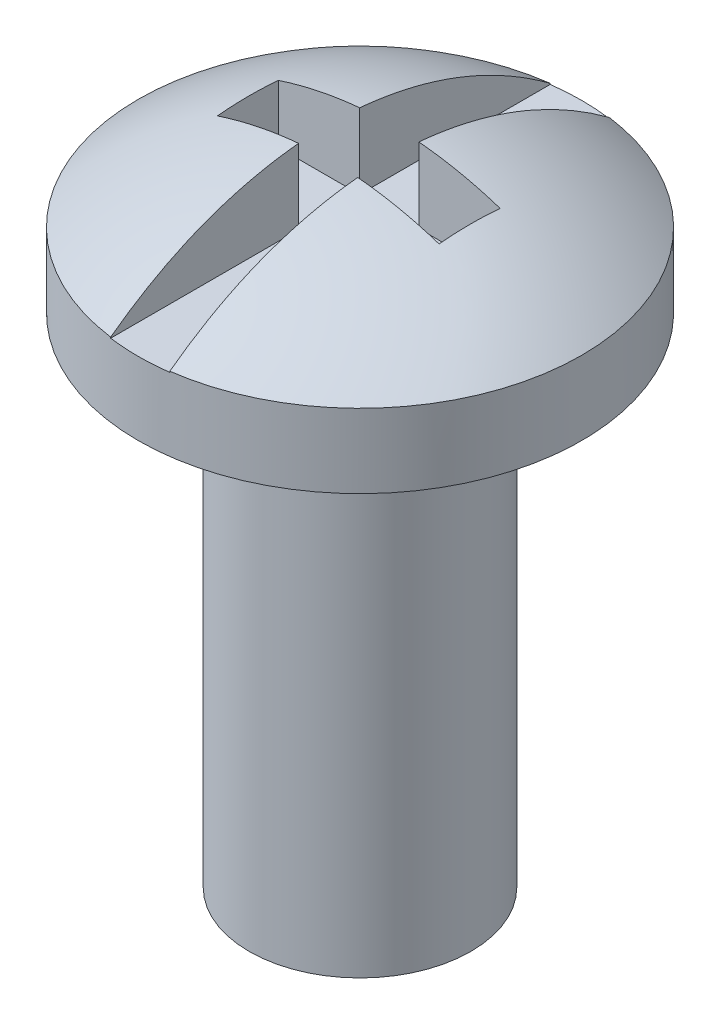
from build123d import *

# Parameters (mm, degrees)
SCHNITT_LINEAR_AUSTRAGEN1_DEPTH = 9.810889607


with BuildPart() as part:
    # Skizze1 → Rotation1 (revolve)
    with BuildSketch(Plane.XY, mode=Mode.PRIVATE) as rotation1_sk:
        with BuildLine():
            Line((-3, -0.986868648), (-1.5, -0.986868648))
            Line((-1.5, -0.986868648), (-1.5, -7.722161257))
            Line((-1.5, -7.722161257), (0, -7.722161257))
            Line((0, -7.722161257), (0, 1.056247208))
            add(Edge.make_bspline(
                [(-3, 0.013131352), (-1.65504596, 1.020141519), (0, 1.056247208)],
                knots=[0, 0, 0, 0.690587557, 0.690587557, 0.690587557], degree=2))
            Line((-3, 0.013131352), (-3, -0.986868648))
        make_face()
    revolve(rotation1_sk.sketch.rotate(Axis((0, 54.476945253, 0), (0, -1, 0)), 270), axis=Axis((0, 54.476945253, 0), (0, -1, 0)))

    # Skizze2 → Schnitt-Linear austragen1 (cut, through all)
    with BuildSketch(Plane(origin=(0, 0, 0), x_dir=(1, 0, 0), z_dir=(0, 1, 0))):
        Polygon((-0.4, 3.573663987), (0.4, 3.573663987), (0.4, 0.395605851), (1.5, 0.395605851), (1.5, -0.43040926), (0.4, -0.43040926), (0.4, -3.41246381), (-0.4, -3.41246381), (-0.4, -0.43040926), (-1.5, -0.43040926), (-1.5, 0.395605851), (-0.4, 0.395605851), align=None)
    extrude(amount=SCHNITT_LINEAR_AUSTRAGEN1_DEPTH, mode=Mode.SUBTRACT)


solid = part.part
